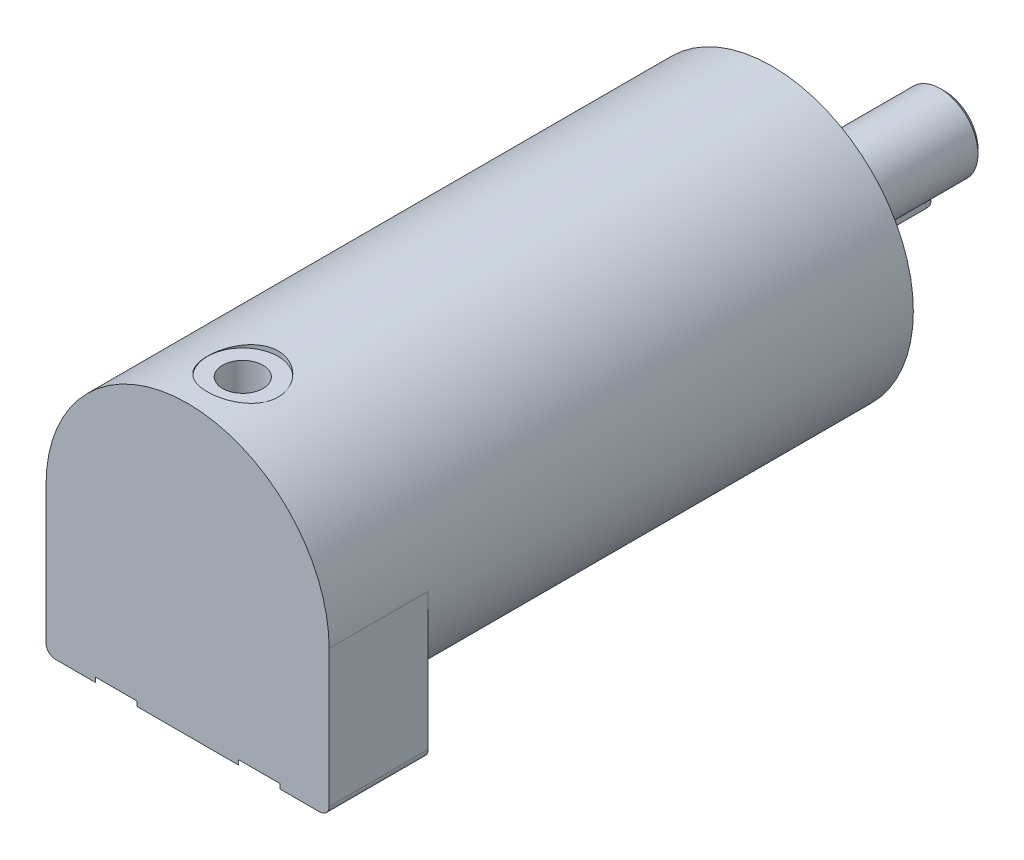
from build123d import *

# Parameters (mm, degrees)
CHANFREIN1_SIZE           = 1
EXTRUSION1_REACH          = 49.519
EXTRUSION1_END_RADIUS     = 8
ESQUISSE5_R               = 30
EXTRUSION2_DEPTH          = 123.8
EXTRUSION3_START          = -21
EXTRUSION3_DEPTH          = 21
ESQUISSE7_R               = 12.5
ENL_V_MAT_EXTRU_1_DEPTH   = 1
ESQUISSE8_R               = 7.475
ENL_V_MAT_EXTRU_2_DEPTH   = 30
ESQUISSE9_R               = 7.5
ENL_V_MAT_EXTRU_3_DEPTH   = 141.8063919
ESQUISSE10_R              = 4.285
ENL_V_MAT_EXTRU_4_DEPTH   = 30
TROU_TARAUD_M6X1_02_D     = 5
TROU_TARAUD_M6X1_02_DEPTH = 15
TROU_TARAUD_M6X1_02_TIP   = 1.502151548
CHANFREIN2_SIZE           = 1


with BuildPart() as part:
    # Esquisse1 → R_volution1 (revolve)
    with BuildSketch(Plane(origin=(0, 0, 0), x_dir=(0, 0, -1), z_dir=(1, 0, 0)), mode=Mode.PRIVATE) as r_volution1_sk:
        Polygon((0, 0), (0, 15.75), (5, 15.75), (5, 8.5), (7.7, 8.5), (7.7, 8), (36.7, 8), (36.7, 0), align=None)
    revolve(r_volution1_sk.sketch.rotate(Axis((0, 0, 0), (0, 0, -1)), 90), axis=Axis((0, 0, 0), (0, 0, -1)))

    # Chanfrein1
    chanfrein1_edges = [part.edges().sort_by_distance(p)[0] for p in [
        (-8, 0, -36.7),
    ]]
    chamfer(chanfrein1_edges, length=CHANFREIN1_SIZE)

    # Esquisse3 → Trou taraud_ M6x1.01 (revolve, cut)
    with BuildSketch(Plane(origin=(0, 0, -36.7), x_dir=(0, 1, 0), z_dir=(1, 0, 0))):
        Polygon((0, 0), (0, 20.502151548), (2.5, 19), (2.5, 3.732050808), (3.5, 0), align=None)
    revolve(axis=Axis((0, 0, -43.05), (0, 0, 1)), mode=Mode.SUBTRACT)

    # Extrusion1: up to this cylinder (the profile starts outside it)
    extrusion1_end = Plane(origin=(0, 0, -24.45), z_dir=(0, 0, 1)) * Cylinder(EXTRUSION1_END_RADIUS, 116.038, mode=Mode.PRIVATE)
    # Esquisse4 → Extrusion1 (add, up to the surface)
    with BuildSketch(Plane(origin=(0, -10, 0), x_dir=(-1, 0, 0), z_dir=(0, 1, 0)), mode=Mode.PRIVATE) as extrusion1_sk1:
        with BuildLine():
            Line((-2.5, -18.7), (-2.5, -30.2))
            ThreePointArc((-2.5, -30.2), (0, -32.7), (2.5, -30.2))
            Line((2.5, -30.2), (2.5, -18.7))
            ThreePointArc((2.5, -18.7), (0, -16.2), (-2.5, -18.7))
        make_face()
    extrusion1_tool1 = extrude(extrusion1_sk1.sketch, amount=EXTRUSION1_REACH, mode=Mode.PRIVATE) - extrusion1_end
    add(extrusion1_tool1.solids().sort_by_distance((0, -10, -24.45))[0])

    # Esquisse5 → Extrusion2 (add)
    with BuildSketch(Plane.XY):
        Circle(ESQUISSE5_R)
    extrude(amount=EXTRUSION2_DEPTH)

    # Esquisse6 → Extrusion3 (add)
    with BuildSketch(Plane.XY.offset(123.8).offset(EXTRUSION3_START)):
        with BuildLine():
            Line((-30, 0), (-30, -29))
            ThreePointArc((-30, -29), (-29.414213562, -30.414213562), (-28, -31))
            Line((-28, -31), (28, -31))
            ThreePointArc((28, -31), (29.414213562, -30.414213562), (30, -29))
            Line((30, -29), (30, 0))
            ThreePointArc((30, 0), (0, -30), (-30, 0))
        make_face()
    extrude(amount=EXTRUSION3_DEPTH)

    # Esquisse7 → Enl_v. mat.-Extru.1 (cut)
    with BuildSketch(Plane.XZ.offset(31)):
        with Locations((-15.15, 112.1)):
            Circle(ESQUISSE7_R)
        with Locations((15.15, 112.1)):
            Circle(ESQUISSE7_R)
    extrude(amount=-ENL_V_MAT_EXTRU_1_DEPTH, mode=Mode.SUBTRACT)

    # Esquisse8 → Enl_v. mat.-Extru.2 (cut)
    with BuildSketch(Plane.XZ.offset(30)):
        with Locations((15.15, 112.1)):
            Circle(ESQUISSE8_R)
        with Locations((-15.15, 112.1)):
            Circle(ESQUISSE8_R)
    extrude(amount=-ENL_V_MAT_EXTRU_2_DEPTH, mode=Mode.SUBTRACT)

    # Esquisse9 → Enl_v. mat.-Extru.3 (cut, through all)
    with BuildSketch(Plane(origin=(0, 29, 0), x_dir=(-1, 0, 0), z_dir=(0, 1, 0))):
        with Locations(Location((0, 112.1, 0), (0, 0, 270))):
            Circle(ESQUISSE9_R)
    extrude(amount=ENL_V_MAT_EXTRU_3_DEPTH, mode=Mode.SUBTRACT)

    # Esquisse10 → Enl_v. mat.-Extru.4 (cut)
    with BuildSketch(Plane(origin=(0, 29, 0), x_dir=(-1, 0, 0), z_dir=(0, 1, 0))):
        with Locations(Location((0, 112.1, 0), (0, 0, 90))):
            Circle(ESQUISSE10_R)
    extrude(amount=-ENL_V_MAT_EXTRU_4_DEPTH, mode=Mode.SUBTRACT)

    # Trou taraud_ M6x1.02
    with Locations(Plane(origin=(0, -22.5, 0), x_dir=(-1, 0, 0), z_dir=(0, 0, -1))):
        with Locations((0, 0), (15.909902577, 38.409902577), (-15.909902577, 38.409902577)):
            Hole(TROU_TARAUD_M6X1_02_D / 2, depth=TROU_TARAUD_M6X1_02_DEPTH)
            with Locations((0, 0, -(TROU_TARAUD_M6X1_02_DEPTH + TROU_TARAUD_M6X1_02_TIP / 2))):  # 118° drill point
                Cone(0, TROU_TARAUD_M6X1_02_D / 2, TROU_TARAUD_M6X1_02_TIP, mode=Mode.SUBTRACT)

    # Chanfrein2
    chanfrein2_edges = [part.edges().sort_by_distance(p)[0] for p in [
        (-15.75, 0, -5),
    ]]
    chamfer(chanfrein2_edges, length=CHANFREIN2_SIZE)


solid = part.part
